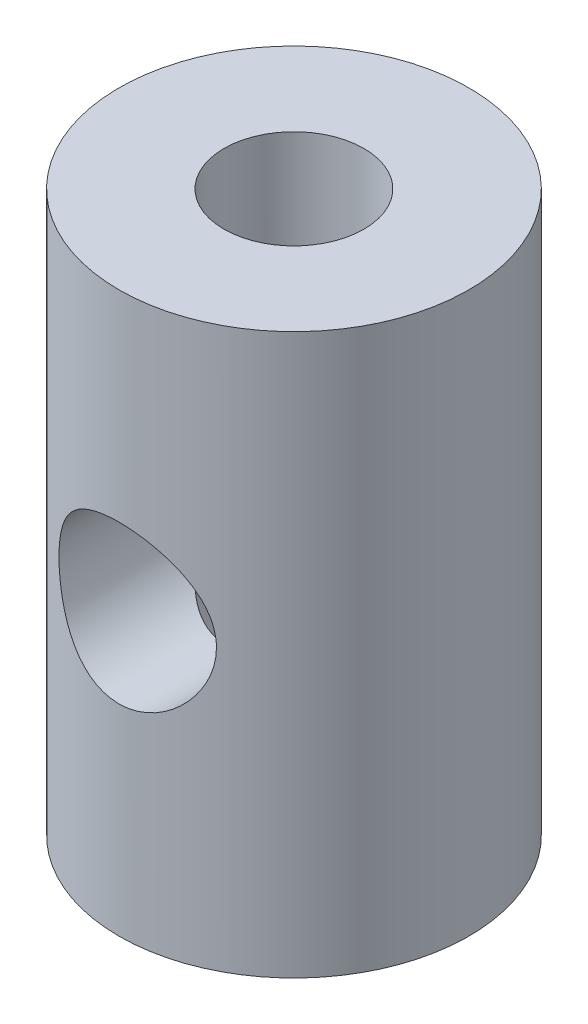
ISO-10303-21;
HEADER;
FILE_DESCRIPTION(('STEP AP214'),'2;1');
FILE_NAME('part.step','',(''),(''),'','','');
FILE_SCHEMA(('AUTOMOTIVE_DESIGN { 1 0 10303 214 1 1 1 1 }'));
ENDSEC;
DATA;
#1=APPLICATION_CONTEXT('core data for automotive mechanical design processes');
#2=APPLICATION_PROTOCOL_DEFINITION('international standard','automotive_design',2000,#1);
#3=PRODUCT_CONTEXT('',#1,'mechanical');
#4=PRODUCT('Part','Part','',(#3));
#5=PRODUCT_RELATED_PRODUCT_CATEGORY('part','',(#4));
#6=PRODUCT_DEFINITION_FORMATION('','',#4);
#7=PRODUCT_DEFINITION_CONTEXT('part definition',#1,'design');
#8=PRODUCT_DEFINITION('design','',#6,#7);
#9=PRODUCT_DEFINITION_SHAPE('','',#8);
#10=(LENGTH_UNIT() NAMED_UNIT(*) SI_UNIT(.MILLI.,.METRE.));
#11=(NAMED_UNIT(*) PLANE_ANGLE_UNIT() SI_UNIT($,.RADIAN.));
#12=(NAMED_UNIT(*) SI_UNIT($,.STERADIAN.) SOLID_ANGLE_UNIT());
#13=UNCERTAINTY_MEASURE_WITH_UNIT(LENGTH_MEASURE(1.E-05),#10,'distance_accuracy_value','');
#14=(GEOMETRIC_REPRESENTATION_CONTEXT(3) GLOBAL_UNCERTAINTY_ASSIGNED_CONTEXT((#13)) GLOBAL_UNIT_ASSIGNED_CONTEXT((#10,
#11,#12)) REPRESENTATION_CONTEXT('',''));
#15=CARTESIAN_POINT('',(0.,0.,0.));
#16=DIRECTION('',(0.,0.,1.));
#17=DIRECTION('',(1.,0.,0.));
#18=AXIS2_PLACEMENT_3D('',#15,#16,#17);
#19=CARTESIAN_POINT('',(0.,16.,0.));
#20=DIRECTION('',(0.,-1.,0.));
#21=DIRECTION('',(0.,0.,-1.));
#22=AXIS2_PLACEMENT_3D('',#19,#20,#21);
#23=CYLINDRICAL_SURFACE('',#22,2.);
#24=CARTESIAN_POINT('',(0.,10.25,-2.));
#25=CARTESIAN_POINT('',(-0.0929564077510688,10.2499928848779,-1.99999277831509));
#26=CARTESIAN_POINT('',(-0.186058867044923,10.2441806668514,-1.99346015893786));
#27=CARTESIAN_POINT('',(-0.369214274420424,10.2214292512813,-1.96781134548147));
#28=CARTESIAN_POINT('',(-0.459259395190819,10.2044634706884,-1.94866508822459));
#29=CARTESIAN_POINT('',(-0.633059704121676,10.1609505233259,-1.89930052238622));
#30=CARTESIAN_POINT('',(-0.716853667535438,10.1344696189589,-1.86915876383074));
#31=CARTESIAN_POINT('',(-0.877280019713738,10.073705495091,-1.79945647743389));
#32=CARTESIAN_POINT('',(-0.953912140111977,10.0394219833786,-1.75989559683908));
#33=CARTESIAN_POINT('',(-1.12793372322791,9.95018206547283,-1.65580731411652));
#34=CARTESIAN_POINT('',(-1.22165621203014,9.89239449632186,-1.58757647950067));
#35=CARTESIAN_POINT('',(-1.39363403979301,9.76960730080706,-1.43901519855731));
#36=CARTESIAN_POINT('',(-1.47184818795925,9.70458916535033,-1.35865350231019));
#37=CARTESIAN_POINT('',(-1.61463934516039,9.57010119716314,-1.18567391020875));
#38=CARTESIAN_POINT('',(-1.67886658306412,9.50056382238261,-1.09281925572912));
#39=CARTESIAN_POINT('',(-1.76327556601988,9.39832963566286,-0.945537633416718));
#40=CARTESIAN_POINT('',(-1.78941260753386,9.3646141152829,-0.895139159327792));
#41=CARTESIAN_POINT('',(-1.8376552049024,9.29891345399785,-0.791389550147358));
#42=CARTESIAN_POINT('',(-1.85976357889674,9.26692711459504,-0.738040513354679));
#43=CARTESIAN_POINT('',(-1.89995996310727,9.2058201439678,-0.627418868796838));
#44=CARTESIAN_POINT('',(-1.91800292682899,9.17673344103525,-0.570110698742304));
#45=CARTESIAN_POINT('',(-1.94927987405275,9.12416284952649,-0.451713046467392));
#46=CARTESIAN_POINT('',(-1.96252088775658,9.10067078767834,-0.390629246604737));
#47=CARTESIAN_POINT('',(-1.98170478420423,9.06568420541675,-0.275101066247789));
#48=CARTESIAN_POINT('',(-1.98849014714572,9.05285143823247,-0.221218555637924));
#49=CARTESIAN_POINT('',(-1.99762242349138,9.03542692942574,-0.111807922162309));
#50=CARTESIAN_POINT('',(-1.99997899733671,9.03081725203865,-0.0562836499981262));
#51=CARTESIAN_POINT('',(-2.00002077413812,9.030736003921,0.0549240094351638));
#52=CARTESIAN_POINT('',(-1.99769344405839,9.03528895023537,0.110607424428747));
#53=CARTESIAN_POINT('',(-1.98859319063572,9.05265713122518,0.220329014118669));
#54=CARTESIAN_POINT('',(-1.98181075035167,9.06549005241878,0.274363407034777));
#55=CARTESIAN_POINT('',(-1.95983519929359,9.10557002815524,0.406952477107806));
#56=CARTESIAN_POINT('',(-1.94211061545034,9.13683578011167,0.483828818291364));
#57=CARTESIAN_POINT('',(-1.89917300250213,9.2072077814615,0.63176092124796));
#58=CARTESIAN_POINT('',(-1.87392844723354,9.24634680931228,0.702790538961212));
#59=CARTESIAN_POINT('',(-1.82034933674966,9.32315682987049,0.830964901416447));
#60=CARTESIAN_POINT('',(-1.79281996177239,9.3603780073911,0.888724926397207));
#61=CARTESIAN_POINT('',(-1.73277410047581,9.43608163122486,1.00076879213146));
#62=CARTESIAN_POINT('',(-1.70025427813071,9.47456490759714,1.05505027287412));
#63=CARTESIAN_POINT('',(-1.63028908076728,9.55156809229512,1.16023321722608));
#64=CARTESIAN_POINT('',(-1.5928475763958,9.59008794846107,1.21113729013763));
#65=CARTESIAN_POINT('',(-1.51297060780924,9.66627404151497,1.30955575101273));
#66=CARTESIAN_POINT('',(-1.47053442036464,9.70394015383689,1.35706964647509));
#67=CARTESIAN_POINT('',(-1.35275458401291,9.80038969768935,1.4767645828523));
#68=CARTESIAN_POINT('',(-1.27327849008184,9.85784198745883,1.54604850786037));
#69=CARTESIAN_POINT('',(-1.1009991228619,9.96482800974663,1.67308273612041));
#70=CARTESIAN_POINT('',(-1.00822197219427,10.0143768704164,1.73085512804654));
#71=CARTESIAN_POINT('',(-0.830902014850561,10.0927071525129,1.82135112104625));
#72=CARTESIAN_POINT('',(-0.748717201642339,10.1236646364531,1.85678709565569));
#73=CARTESIAN_POINT('',(-0.577684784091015,10.1764118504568,1.91689251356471));
#74=CARTESIAN_POINT('',(-0.488841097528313,10.1982069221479,1.94156823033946));
#75=CARTESIAN_POINT('',(-0.306029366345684,10.231034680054,1.97865895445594));
#76=CARTESIAN_POINT('',(-0.212031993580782,10.2419971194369,1.99099394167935));
#77=CARTESIAN_POINT('',(-0.0226158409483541,10.2518809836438,2.00211767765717));
#78=CARTESIAN_POINT('',(0.0728023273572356,10.2508074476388,2.00091209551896));
#79=CARTESIAN_POINT('',(0.251730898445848,10.2374851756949,1.98591260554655));
#80=CARTESIAN_POINT('',(0.335447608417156,10.2264103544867,1.97344101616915));
#81=CARTESIAN_POINT('',(0.499081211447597,10.1955305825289,1.93853567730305));
#82=CARTESIAN_POINT('',(0.578997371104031,10.1757239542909,1.91610001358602));
#83=CARTESIAN_POINT('',(0.736868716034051,10.1275898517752,1.8612681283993));
#84=CARTESIAN_POINT('',(0.814580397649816,10.0989239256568,1.82847486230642));
#85=CARTESIAN_POINT('',(0.963113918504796,10.0350575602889,1.75479221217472));
#86=CARTESIAN_POINT('',(1.03393336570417,9.99985486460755,1.71390003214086));
#87=CARTESIAN_POINT('',(1.20253143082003,9.90523967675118,1.60271147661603));
#88=CARTESIAN_POINT('',(1.2956478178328,9.84263415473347,1.52805264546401));
#89=CARTESIAN_POINT('',(1.46533078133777,9.71081449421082,1.36625170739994));
#90=CARTESIAN_POINT('',(1.54183517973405,9.6415768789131,1.27906466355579));
#91=CARTESIAN_POINT('',(1.64499481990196,9.53590283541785,1.13905378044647));
#92=CARTESIAN_POINT('',(1.67775234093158,9.4999550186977,1.09023407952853));
#93=CARTESIAN_POINT('',(1.7390038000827,9.42848782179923,0.989616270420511));
#94=CARTESIAN_POINT('',(1.76749541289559,9.39296868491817,0.937816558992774));
#95=CARTESIAN_POINT('',(1.82004009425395,9.32357121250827,0.831247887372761));
#96=CARTESIAN_POINT('',(1.84410780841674,9.28968774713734,0.776489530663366));
#97=CARTESIAN_POINT('',(1.88770084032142,9.22499001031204,0.663511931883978));
#98=CARTESIAN_POINT('',(1.90723208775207,9.19417176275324,0.605297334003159));
#99=CARTESIAN_POINT('',(1.93952111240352,9.14088746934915,0.49130426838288));
#100=CARTESIAN_POINT('',(1.95277905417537,9.11788124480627,0.435927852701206));
#101=CARTESIAN_POINT('',(1.97475253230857,9.07859220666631,0.322027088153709));
#102=CARTESIAN_POINT('',(1.98347964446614,9.06229228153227,0.263511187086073));
#103=CARTESIAN_POINT('',(1.99580152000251,9.03897445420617,0.143086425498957));
#104=CARTESIAN_POINT('',(1.99931831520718,9.03209767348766,0.0811401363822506));
#105=CARTESIAN_POINT('',(2.00049992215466,9.02980777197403,-0.0430078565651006));
#106=CARTESIAN_POINT('',(1.99816730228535,9.03438961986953,-0.105209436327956));
#107=CARTESIAN_POINT('',(1.98761499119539,9.054518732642,-0.231779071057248));
#108=CARTESIAN_POINT('',(1.97898519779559,9.07082864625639,-0.295982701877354));
#109=CARTESIAN_POINT('',(1.95627452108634,9.11176862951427,-0.420767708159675));
#110=CARTESIAN_POINT('',(1.942171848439,9.13643190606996,-0.481333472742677));
#111=CARTESIAN_POINT('',(1.91109037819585,9.18787056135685,-0.592172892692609));
#112=CARTESIAN_POINT('',(1.89460258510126,9.21411015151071,-0.642843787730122));
#113=CARTESIAN_POINT('',(1.85819887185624,9.26912991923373,-0.741526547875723));
#114=CARTESIAN_POINT('',(1.83828019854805,9.29791212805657,-0.789536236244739));
#115=CARTESIAN_POINT('',(1.77359465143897,9.38642509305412,-0.93007280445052));
#116=CARTESIAN_POINT('',(1.72392060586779,9.44828250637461,-1.01903042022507));
#117=CARTESIAN_POINT('',(1.60623869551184,9.57828624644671,-1.19685297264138));
#118=CARTESIAN_POINT('',(1.53689445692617,9.64644308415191,-1.28481963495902));
#119=CARTESIAN_POINT('',(1.3824653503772,9.77807708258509,-1.44965260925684));
#120=CARTESIAN_POINT('',(1.29740762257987,9.84156205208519,-1.52653765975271));
#121=CARTESIAN_POINT('',(1.12925070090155,9.94813101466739,-1.65337339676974));
#122=CARTESIAN_POINT('',(1.04892342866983,9.99279007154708,-1.70566013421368));
#123=CARTESIAN_POINT('',(0.878244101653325,10.0736611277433,-1.79948256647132));
#124=CARTESIAN_POINT('',(0.787899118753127,10.1098790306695,-1.84102577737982));
#125=CARTESIAN_POINT('',(0.613247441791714,10.1664532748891,-1.90557609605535));
#126=CARTESIAN_POINT('',(0.530146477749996,10.1883918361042,-1.93045067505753));
#127=CARTESIAN_POINT('',(0.35964484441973,10.2227612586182,-1.96932773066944));
#128=CARTESIAN_POINT('',(0.272255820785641,10.2352165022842,-1.98335809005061));
#129=CARTESIAN_POINT('',(0.153489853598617,10.2449692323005,-1.99433891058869));
#130=CARTESIAN_POINT('',(0.122867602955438,10.2468524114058,-1.99645842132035));
#131=CARTESIAN_POINT('',(0.0615022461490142,10.2493690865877,-1.99929028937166));
#132=CARTESIAN_POINT('',(0.0307591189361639,10.2500023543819,-2.00000238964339));
#133=CARTESIAN_POINT('',(0.,10.25,-2.));
#134=B_SPLINE_CURVE_WITH_KNOTS('',3,(#24,#25,#26,#27,#28,#29,#30,#31,#32,#33,#34,#35,#36,#37,
#38,#39,#40,#41,#42,#43,#44,#45,#46,#47,#48,#49,#50,#51,#52,#53,#54,#55,#56,#57,#58,#59,#60,#61,
#62,#63,#64,#65,#66,#67,#68,#69,#70,#71,#72,#73,#74,#75,#76,#77,#78,#79,#80,#81,#82,#83,#84,#85,
#86,#87,#88,#89,#90,#91,#92,#93,#94,#95,#96,#97,#98,#99,#100,#101,#102,#103,#104,#105,#106,#107,
#108,#109,#110,#111,#112,#113,#114,#115,#116,#117,#118,#119,#120,#121,#122,#123,#124,#125,#126,
#127,#128,#129,#130,#131,#132,#133),.UNSPECIFIED.,.T.,.F.,(4,2,2,2,2,2,2,2,2,2,2,2,2,2,2,2,2,2,
2,2,2,2,2,2,2,2,2,2,2,2,2,2,2,2,2,2,2,2,2,2,2,2,2,2,2,2,2,2,2,2,2,2,2,2,4),(0.,
0.278730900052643,0.558128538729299,0.835617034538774,1.11311592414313,1.49959348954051,
1.88708419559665,2.28336880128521,2.48130251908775,2.67909724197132,2.87898623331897,
3.07858138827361,3.24532666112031,3.4117077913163,3.57853471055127,3.74571916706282,
3.99886924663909,4.25309591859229,4.47488672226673,4.69682644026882,4.91859264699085,
5.14039100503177,5.49922632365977,5.85736632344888,6.14034666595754,6.42316180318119,
6.7077991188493,6.99231726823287,7.2472434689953,7.50221866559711,7.76848356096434,
8.03484053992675,8.43698820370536,8.84061609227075,9.0471915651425,9.25387923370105,
9.4598698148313,9.66558960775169,9.84937516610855,10.0326888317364,10.2187188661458,
10.4046672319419,10.6039477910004,10.8040300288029,10.9819699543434,11.1600533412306,
11.5164851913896,11.9085488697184,12.2999416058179,12.6160291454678,12.9318949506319,
13.1992189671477,13.4658533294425,13.5580680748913,13.6502996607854),.UNSPECIFIED.);
#135=CARTESIAN_POINT('',(0.,10.25,-2.));
#136=VERTEX_POINT('',#135);
#137=EDGE_CURVE('E35',#136,#136,#134,.T.);
#138=ORIENTED_EDGE('',*,*,#137,.F.);
#139=EDGE_LOOP('',(#138));
#140=FACE_BOUND('',#139,.T.);
#141=CARTESIAN_POINT('',(0.,16.,0.));
#142=DIRECTION('',(0.,1.,0.));
#143=DIRECTION('',(0.,0.,1.));
#144=AXIS2_PLACEMENT_3D('',#141,#142,#143);
#145=CIRCLE('',#144,2.);
#146=CARTESIAN_POINT('',(0.,16.,2.));
#147=VERTEX_POINT('',#146);
#148=EDGE_CURVE('E48',#147,#147,#145,.T.);
#149=ORIENTED_EDGE('',*,*,#148,.T.);
#150=EDGE_LOOP('',(#149));
#151=FACE_BOUND('',#150,.T.);
#152=ADVANCED_FACE('F30',(#140,#151),#23,.F.);
#153=CARTESIAN_POINT('',(0.,16.,0.));
#154=DIRECTION('',(0.,1.,0.));
#155=DIRECTION('',(0.,0.,1.));
#156=AXIS2_PLACEMENT_3D('',#153,#154,#155);
#157=PLANE('',#156);
#158=CARTESIAN_POINT('',(0.,16.,0.));
#159=DIRECTION('',(0.,1.,0.));
#160=DIRECTION('',(0.,0.,1.));
#161=AXIS2_PLACEMENT_3D('',#158,#159,#160);
#162=CIRCLE('',#161,5.);
#163=CARTESIAN_POINT('',(0.,16.,5.));
#164=VERTEX_POINT('',#163);
#165=EDGE_CURVE('E10',#164,#164,#162,.T.);
#166=ORIENTED_EDGE('',*,*,#165,.T.);
#167=EDGE_LOOP('',(#166));
#168=FACE_BOUND('',#167,.T.);
#169=ORIENTED_EDGE('',*,*,#148,.F.);
#170=EDGE_LOOP('',(#169));
#171=FACE_BOUND('',#170,.T.);
#172=ADVANCED_FACE('F82',(#168,#171),#157,.T.);
#173=CARTESIAN_POINT('',(0.,0.,0.));
#174=DIRECTION('',(0.,1.,0.));
#175=DIRECTION('',(0.,0.,1.));
#176=AXIS2_PLACEMENT_3D('',#173,#174,#175);
#177=PLANE('',#176);
#178=CARTESIAN_POINT('',(0.,0.,0.));
#179=DIRECTION('',(0.,1.,0.));
#180=DIRECTION('',(0.,0.,1.));
#181=AXIS2_PLACEMENT_3D('',#178,#179,#180);
#182=CIRCLE('',#181,5.);
#183=CARTESIAN_POINT('',(0.,0.,5.));
#184=VERTEX_POINT('',#183);
#185=EDGE_CURVE('E43',#184,#184,#182,.T.);
#186=ORIENTED_EDGE('',*,*,#185,.F.);
#187=EDGE_LOOP('',(#186));
#188=FACE_BOUND('',#187,.T.);
#189=CARTESIAN_POINT('',(0.,0.,0.));
#190=DIRECTION('',(0.,1.,0.));
#191=DIRECTION('',(0.,0.,1.));
#192=AXIS2_PLACEMENT_3D('',#189,#190,#191);
#193=CIRCLE('',#192,2.);
#194=CARTESIAN_POINT('',(0.,0.,2.));
#195=VERTEX_POINT('',#194);
#196=EDGE_CURVE('E76',#195,#195,#193,.T.);
#197=ORIENTED_EDGE('',*,*,#196,.T.);
#198=EDGE_LOOP('',(#197));
#199=FACE_BOUND('',#198,.T.);
#200=ADVANCED_FACE('F84',(#188,#199),#177,.F.);
#201=CARTESIAN_POINT('',(0.,16.,0.));
#202=DIRECTION('',(0.,-1.,0.));
#203=DIRECTION('',(0.,0.,-1.));
#204=AXIS2_PLACEMENT_3D('',#201,#202,#203);
#205=CYLINDRICAL_SURFACE('',#204,5.);
#206=CARTESIAN_POINT('',(0.,10.25,-5.));
#207=CARTESIAN_POINT('',(-0.119657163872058,10.2499941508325,-4.9999951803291));
#208=CARTESIAN_POINT('',(-0.239497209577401,10.240398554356,-4.9956568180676));
#209=CARTESIAN_POINT('',(-0.47572081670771,10.2024004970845,-4.97873356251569));
#210=CARTESIAN_POINT('',(-0.59209555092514,10.1739536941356,-4.96612922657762));
#211=CARTESIAN_POINT('',(-0.817598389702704,10.0995417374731,-4.93401032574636));
#212=CARTESIAN_POINT('',(-0.926750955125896,10.0536396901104,-4.91452067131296));
#213=CARTESIAN_POINT('',(-1.13568251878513,9.94590630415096,-4.87048664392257));
#214=CARTESIAN_POINT('',(-1.23546350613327,9.88407835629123,-4.84594334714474));
#215=CARTESIAN_POINT('',(-1.42864166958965,9.74257025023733,-4.7926545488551));
#216=CARTESIAN_POINT('',(-1.52144083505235,9.66213152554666,-4.76375726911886));
#217=CARTESIAN_POINT('',(-1.69276142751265,9.48729760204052,-4.7056093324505));
#218=CARTESIAN_POINT('',(-1.77127412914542,9.3928939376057,-4.67635847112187));
#219=CARTESIAN_POINT('',(-1.91644184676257,9.18602120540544,-4.61884309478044));
#220=CARTESIAN_POINT('',(-1.98211224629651,9.07281109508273,-4.59074106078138));
#221=CARTESIAN_POINT('',(-2.09321326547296,8.83551854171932,-4.54116574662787));
#222=CARTESIAN_POINT('',(-2.13865597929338,8.7114426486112,-4.51968850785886));
#223=CARTESIAN_POINT('',(-2.2054422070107,8.462806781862,-4.48746493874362));
#224=CARTESIAN_POINT('',(-2.22794402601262,8.33862717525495,-4.47620638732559));
#225=CARTESIAN_POINT('',(-2.25180742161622,8.08778459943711,-4.46425372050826));
#226=CARTESIAN_POINT('',(-2.25318367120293,7.96112341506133,-4.46355227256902));
#227=CARTESIAN_POINT('',(-2.23561914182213,7.72141805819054,-4.47236713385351));
#228=CARTESIAN_POINT('',(-2.2185407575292,7.60819554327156,-4.48094689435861));
#229=CARTESIAN_POINT('',(-2.16771485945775,7.38643802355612,-4.5057522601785));
#230=CARTESIAN_POINT('',(-2.13396347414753,7.27790411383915,-4.52197964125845));
#231=CARTESIAN_POINT('',(-2.05008139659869,7.06566133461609,-4.56062840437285));
#232=CARTESIAN_POINT('',(-1.99959732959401,6.96211723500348,-4.58318164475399));
#233=CARTESIAN_POINT('',(-1.88393825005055,6.76452590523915,-4.63192287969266));
#234=CARTESIAN_POINT('',(-1.81875698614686,6.67048274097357,-4.65811241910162));
#235=CARTESIAN_POINT('',(-1.66791131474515,6.48464932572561,-4.71435794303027));
#236=CARTESIAN_POINT('',(-1.58084940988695,6.39402761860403,-4.74453849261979));
#237=CARTESIAN_POINT('',(-1.39252160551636,6.22824166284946,-4.80318714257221));
#238=CARTESIAN_POINT('',(-1.2912512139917,6.15308232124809,-4.83165469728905));
#239=CARTESIAN_POINT('',(-1.07332333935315,6.01823622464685,-4.88476427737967));
#240=CARTESIAN_POINT('',(-0.956286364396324,5.95910093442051,-4.90926046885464));
#241=CARTESIAN_POINT('',(-0.712539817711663,5.86178202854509,-4.95050723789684));
#242=CARTESIAN_POINT('',(-0.585836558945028,5.82358486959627,-4.96726282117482));
#243=CARTESIAN_POINT('',(-0.336050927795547,5.77184799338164,-4.99015693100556));
#244=CARTESIAN_POINT('',(-0.213354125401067,5.75674488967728,-4.99696705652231));
#245=CARTESIAN_POINT('',(0.0330028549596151,5.74687062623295,-5.00140648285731));
#246=CARTESIAN_POINT('',(0.156662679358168,5.75209232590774,-4.99903900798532));
#247=CARTESIAN_POINT('',(0.393606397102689,5.78167252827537,-4.98581223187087));
#248=CARTESIAN_POINT('',(0.507068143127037,5.80486612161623,-4.97547003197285));
#249=CARTESIAN_POINT('',(0.728326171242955,5.86803312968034,-4.94792660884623));
#250=CARTESIAN_POINT('',(0.836121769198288,5.90800856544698,-4.93072455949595));
#251=CARTESIAN_POINT('',(1.0468032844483,6.00486454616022,-4.89040595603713));
#252=CARTESIAN_POINT('',(1.14943204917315,6.06223242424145,-4.86712201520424));
#253=CARTESIAN_POINT('',(1.34397554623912,6.19171384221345,-4.81703610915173));
#254=CARTESIAN_POINT('',(1.43588556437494,6.26383383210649,-4.79023260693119));
#255=CARTESIAN_POINT('',(1.61437331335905,6.427690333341,-4.73321088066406));
#256=CARTESIAN_POINT('',(1.69988735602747,6.52055366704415,-4.70289328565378));
#257=CARTESIAN_POINT('',(1.85448776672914,6.71966056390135,-4.64410716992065));
#258=CARTESIAN_POINT('',(1.92356783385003,6.82590923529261,-4.61563936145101));
#259=CARTESIAN_POINT('',(2.0448687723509,7.05241199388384,-4.56322301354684));
#260=CARTESIAN_POINT('',(2.0966129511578,7.17295491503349,-4.53940877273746));
#261=CARTESIAN_POINT('',(2.17856642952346,7.42246637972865,-4.50065987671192));
#262=CARTESIAN_POINT('',(2.20879749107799,7.55142626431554,-4.4857162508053));
#263=CARTESIAN_POINT('',(2.24454528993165,7.802147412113,-4.46792778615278));
#264=CARTESIAN_POINT('',(2.25196758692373,7.92357111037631,-4.46415115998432));
#265=CARTESIAN_POINT('',(2.24714266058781,8.16591064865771,-4.46658268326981));
#266=CARTESIAN_POINT('',(2.23489992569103,8.28682659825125,-4.47278855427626));
#267=CARTESIAN_POINT('',(2.19277345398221,8.5167678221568,-4.49357716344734));
#268=CARTESIAN_POINT('',(2.16405328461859,8.62606166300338,-4.50760581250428));
#269=CARTESIAN_POINT('',(2.09103437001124,8.83825696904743,-4.54193721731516));
#270=CARTESIAN_POINT('',(2.04673109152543,8.94115656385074,-4.56224179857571));
#271=CARTESIAN_POINT('',(1.94052895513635,9.14494258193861,-4.60845986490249));
#272=CARTESIAN_POINT('',(1.87767694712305,9.24526778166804,-4.63465129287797));
#273=CARTESIAN_POINT('',(1.7373806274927,9.43453794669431,-4.68904747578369));
#274=CARTESIAN_POINT('',(1.65993003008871,9.52347798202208,-4.71725309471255));
#275=CARTESIAN_POINT('',(1.48434630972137,9.69578262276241,-4.77556462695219));
#276=CARTESIAN_POINT('',(1.3849750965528,9.77791205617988,-4.8056111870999));
#277=CARTESIAN_POINT('',(1.17282336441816,9.92447460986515,-4.8617393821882));
#278=CARTESIAN_POINT('',(1.06003671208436,9.98889959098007,-4.88781919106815));
#279=CARTESIAN_POINT('',(0.825071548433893,10.0972194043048,-4.93289199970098));
#280=CARTESIAN_POINT('',(0.702997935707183,10.1413126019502,-4.95195309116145));
#281=CARTESIAN_POINT('',(0.452281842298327,10.2078630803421,-4.9810892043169));
#282=CARTESIAN_POINT('',(0.323660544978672,10.2303859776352,-4.9911914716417));
#283=CARTESIAN_POINT('',(0.161835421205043,10.244407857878,-4.99748612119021));
#284=CARTESIAN_POINT('',(0.129515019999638,10.2465028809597,-4.99842714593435));
#285=CARTESIAN_POINT('',(0.0648008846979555,10.2492997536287,-4.99968474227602));
#286=CARTESIAN_POINT('',(0.032407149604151,10.2500015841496,-5.00000130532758));
#287=CARTESIAN_POINT('',(0.,10.25,-5.));
#288=B_SPLINE_CURVE_WITH_KNOTS('',3,(#206,#207,#208,#209,#210,#211,#212,#213,#214,#215,#216,
#217,#218,#219,#220,#221,#222,#223,#224,#225,#226,#227,#228,#229,#230,#231,#232,#233,#234,#235,
#236,#237,#238,#239,#240,#241,#242,#243,#244,#245,#246,#247,#248,#249,#250,#251,#252,#253,#254,
#255,#256,#257,#258,#259,#260,#261,#262,#263,#264,#265,#266,#267,#268,#269,#270,#271,#272,#273,
#274,#275,#276,#277,#278,#279,#280,#281,#282,#283,#284,#285,#286,#287),.UNSPECIFIED.,.T.,.F.,(4,
2,2,2,2,2,2,2,2,2,2,2,2,2,2,2,2,2,2,2,2,2,2,2,2,2,2,2,2,2,2,2,2,2,2,2,2,2,2,2,4),(0.,
0.358838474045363,0.718524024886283,1.07692137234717,1.43524247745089,1.81211589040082,
2.18921870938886,2.58877923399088,2.98810053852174,3.36607753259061,3.74379198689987,
4.08666490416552,4.42961747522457,4.78033096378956,5.13119390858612,5.51719011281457,
5.90330862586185,6.30138888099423,6.69921134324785,7.06867955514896,7.43801797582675,
7.78523528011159,8.13249441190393,8.49055929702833,8.84878107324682,9.23652488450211,
9.62441712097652,10.0222360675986,10.4196520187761,10.782814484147,11.1458940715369,
11.486031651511,11.8262682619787,12.1885231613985,12.5509343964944,12.9461798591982,
13.3416067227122,13.7330894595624,14.1233774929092,14.2205615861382,14.3177470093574),.UNSPECIFIED.);
#289=CARTESIAN_POINT('',(0.,10.25,-5.));
#290=VERTEX_POINT('',#289);
#291=EDGE_CURVE('E71',#290,#290,#288,.T.);
#292=ORIENTED_EDGE('',*,*,#291,.T.);
#293=EDGE_LOOP('',(#292));
#294=FACE_BOUND('',#293,.T.);
#295=CARTESIAN_POINT('',(2.25,8.,4.46514277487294));
#296=CARTESIAN_POINT('',(2.24999304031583,7.8810387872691,4.46515039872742));
#297=CARTESIAN_POINT('',(2.24050444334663,7.76188521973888,4.4699666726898));
#298=CARTESIAN_POINT('',(2.20296952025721,7.52710182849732,4.48857891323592));
#299=CARTESIAN_POINT('',(2.17487687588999,7.41148155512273,4.50239729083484));
#300=CARTESIAN_POINT('',(2.10149811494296,7.18758402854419,4.53710585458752));
#301=CARTESIAN_POINT('',(2.05629003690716,7.07927603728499,4.55796389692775));
#302=CARTESIAN_POINT('',(1.95019826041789,6.87180924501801,4.6043530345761));
#303=CARTESIAN_POINT('',(1.88931647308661,6.77264933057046,4.62988356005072));
#304=CARTESIAN_POINT('',(1.74886682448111,6.57901523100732,4.6848168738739));
#305=CARTESIAN_POINT('',(1.66832919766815,6.48528506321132,4.71436409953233));
#306=CARTESIAN_POINT('',(1.49288314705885,6.31210092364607,4.77282391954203));
#307=CARTESIAN_POINT('',(1.39796864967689,6.23265301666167,4.80173623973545));
#308=CARTESIAN_POINT('',(1.19040340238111,6.08626420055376,4.85747480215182));
#309=CARTESIAN_POINT('',(1.07708634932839,6.02019024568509,4.88411395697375));
#310=CARTESIAN_POINT('',(0.839526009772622,5.90837301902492,4.93049745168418));
#311=CARTESIAN_POINT('',(0.715288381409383,5.86261929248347,4.95024533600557));
#312=CARTESIAN_POINT('',(0.467253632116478,5.79553127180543,4.97959116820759));
#313=CARTESIAN_POINT('',(0.343870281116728,5.77290580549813,4.98972320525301));
#314=CARTESIAN_POINT('',(0.0946715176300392,5.74851393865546,5.00065622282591));
#315=CARTESIAN_POINT('',(-0.0311427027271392,5.7467375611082,5.00146166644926));
#316=CARTESIAN_POINT('',(-0.272124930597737,5.76348461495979,4.99394241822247));
#317=CARTESIAN_POINT('',(-0.387416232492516,5.78058029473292,4.98625984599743));
#318=CARTESIAN_POINT('',(-0.613288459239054,5.83209818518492,4.96354367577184));
#319=CARTESIAN_POINT('',(-0.723869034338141,5.86652167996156,4.94850953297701));
#320=CARTESIAN_POINT('',(-0.939228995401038,5.95207805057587,4.91222614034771));
#321=CARTESIAN_POINT('',(-1.04389475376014,6.00345678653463,4.8908859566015));
#322=CARTESIAN_POINT('',(-1.24339321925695,6.12119629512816,4.84401587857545));
#323=CARTESIAN_POINT('',(-1.3382223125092,6.1875625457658,4.81848445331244));
#324=CARTESIAN_POINT('',(-1.52345175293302,6.33955583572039,4.76331481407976));
#325=CARTESIAN_POINT('',(-1.61288673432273,6.42630082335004,4.73351145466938));
#326=CARTESIAN_POINT('',(-1.77639992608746,6.61350730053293,4.67460929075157));
#327=CARTESIAN_POINT('',(-1.85047011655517,6.71397590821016,4.6455108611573));
#328=CARTESIAN_POINT('',(-1.9842398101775,6.93123567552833,4.59001891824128));
#329=CARTESIAN_POINT('',(-2.04317215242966,7.04854743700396,4.56379860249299));
#330=CARTESIAN_POINT('',(-2.14003834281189,7.29291404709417,4.51919374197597));
#331=CARTESIAN_POINT('',(-2.17799005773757,7.41996050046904,4.50080253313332));
#332=CARTESIAN_POINT('',(-2.22914248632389,7.67049373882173,4.47567706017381));
#333=CARTESIAN_POINT('',(-2.24392437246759,7.79358138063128,4.46820077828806));
#334=CARTESIAN_POINT('',(-2.25302242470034,8.04067931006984,4.46362263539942));
#335=CARTESIAN_POINT('',(-2.2473478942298,8.16468915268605,4.46651605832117));
#336=CARTESIAN_POINT('',(-2.21714216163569,8.39960016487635,4.48157509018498));
#337=CARTESIAN_POINT('',(-2.19415743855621,8.51075580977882,4.49297960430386));
#338=CARTESIAN_POINT('',(-2.13212542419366,8.72749965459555,4.52274424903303));
#339=CARTESIAN_POINT('',(-2.09307393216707,8.83308639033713,4.54110619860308));
#340=CARTESIAN_POINT('',(-1.99809284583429,9.04104817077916,4.58371481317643));
#341=CARTESIAN_POINT('',(-1.94148122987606,9.14306336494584,4.60818960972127));
#342=CARTESIAN_POINT('',(-1.81362927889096,9.33668361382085,4.65998955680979));
#343=CARTESIAN_POINT('',(-1.74238196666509,9.42828367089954,4.68731606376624));
#344=CARTESIAN_POINT('',(-1.57908877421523,9.60782553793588,4.74496334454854));
#345=CARTESIAN_POINT('',(-1.48568977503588,9.69453189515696,4.77531541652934));
#346=CARTESIAN_POINT('',(-1.28502997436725,9.85132654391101,4.8331762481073));
#347=CARTESIAN_POINT('',(-1.17776699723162,9.92141222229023,4.86068456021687));
#348=CARTESIAN_POINT('',(-0.950682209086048,10.0433961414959,4.91017542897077));
#349=CARTESIAN_POINT('',(-0.830745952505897,10.0951062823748,4.93210022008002));
#350=CARTESIAN_POINT('',(-0.582619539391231,10.1771762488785,4.96751583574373));
#351=CARTESIAN_POINT('',(-0.454435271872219,10.2075511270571,4.98101260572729));
#352=CARTESIAN_POINT('',(-0.204394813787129,10.2439710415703,4.99726613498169));
#353=CARTESIAN_POINT('',(-0.0828396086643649,10.2517498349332,5.00078768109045));
#354=CARTESIAN_POINT('',(0.15984827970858,10.2475911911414,4.99891579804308));
#355=CARTESIAN_POINT('',(0.280981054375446,10.2356583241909,4.99352443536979));
#356=CARTESIAN_POINT('',(0.513549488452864,10.1936476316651,4.97486307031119));
#357=CARTESIAN_POINT('',(0.625174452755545,10.1644355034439,4.96196940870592));
#358=CARTESIAN_POINT('',(0.84184525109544,10.089721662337,4.92983796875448));
#359=CARTESIAN_POINT('',(0.946889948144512,10.0442171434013,4.9105990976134));
#360=CARTESIAN_POINT('',(1.1527517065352,9.93592510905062,4.86649288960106));
#361=CARTESIAN_POINT('',(1.25315478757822,9.87244147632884,4.84140812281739));
#362=CARTESIAN_POINT('',(1.4423245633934,9.73094458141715,4.78846161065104));
#363=CARTESIAN_POINT('',(1.53108621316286,9.65292505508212,4.76059867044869));
#364=CARTESIAN_POINT('',(1.70196716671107,9.47716364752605,4.70235094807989));
#365=CARTESIAN_POINT('',(1.78296764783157,9.37833667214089,4.67194455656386));
#366=CARTESIAN_POINT('',(1.92749297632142,9.16773520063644,4.61420006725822));
#367=CARTESIAN_POINT('',(1.99100658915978,9.05595244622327,4.58686394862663));
#368=CARTESIAN_POINT('',(2.09879543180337,8.82115153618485,4.53856864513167));
#369=CARTESIAN_POINT('',(2.14295192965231,8.69806949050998,4.51764904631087));
#370=CARTESIAN_POINT('',(2.19275164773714,8.50854501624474,4.49356898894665));
#371=CARTESIAN_POINT('',(2.20660710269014,8.44461510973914,4.48676181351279));
#372=CARTESIAN_POINT('',(2.22871677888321,8.31558360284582,4.47582163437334));
#373=CARTESIAN_POINT('',(2.2369751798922,8.25048291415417,4.47168663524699));
#374=CARTESIAN_POINT('',(2.2449126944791,8.15434233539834,4.46770340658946));
#375=CARTESIAN_POINT('',(2.24681915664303,8.12351408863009,4.46674464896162));
#376=CARTESIAN_POINT('',(2.24936373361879,8.06179488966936,4.46546333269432));
#377=CARTESIAN_POINT('',(2.25000180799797,8.03090393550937,4.46514079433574));
#378=CARTESIAN_POINT('',(2.25,8.,4.46514277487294));
#379=B_SPLINE_CURVE_WITH_KNOTS('',3,(#295,#296,#297,#298,#299,#300,#301,#302,#303,#304,#305,
#306,#307,#308,#309,#310,#311,#312,#313,#314,#315,#316,#317,#318,#319,#320,#321,#322,#323,#324,
#325,#326,#327,#328,#329,#330,#331,#332,#333,#334,#335,#336,#337,#338,#339,#340,#341,#342,#343,
#344,#345,#346,#347,#348,#349,#350,#351,#352,#353,#354,#355,#356,#357,#358,#359,#360,#361,#362,
#363,#364,#365,#366,#367,#368,#369,#370,#371,#372,#373,#374,#375,#376,#377,#378),.UNSPECIFIED.,
.T.,.F.,(4,2,2,2,2,2,2,2,2,2,2,2,2,2,2,2,2,2,2,2,2,2,2,2,2,2,2,2,2,2,2,2,2,2,2,2,2,2,2,2,2,4),
(0.,0.356759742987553,0.714411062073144,1.07045091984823,1.4264473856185,1.80599601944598,
2.18570544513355,2.58519198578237,2.98447275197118,3.35999219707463,3.73533193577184,
4.08410830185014,4.43291051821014,4.78701075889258,5.14124063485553,5.52388400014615,
5.90672659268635,6.30625734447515,6.70544733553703,7.0759816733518,7.44634751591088,
7.78705357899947,8.1278487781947,8.48402022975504,8.84036187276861,9.23157909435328,
9.62285778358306,10.0180336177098,10.412930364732,10.7766046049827,11.1401945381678,
11.4869501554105,11.83376552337,12.1964652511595,12.5593216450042,12.9515422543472,
13.3440142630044,13.7388610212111,13.9359176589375,14.1328269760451,14.2255036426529,
14.318183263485),.UNSPECIFIED.);
#380=CARTESIAN_POINT('',(2.25,8.,4.46514277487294));
#381=VERTEX_POINT('',#380);
#382=EDGE_CURVE('E67',#381,#381,#379,.T.);
#383=ORIENTED_EDGE('',*,*,#382,.T.);
#384=EDGE_LOOP('',(#383));
#385=FACE_BOUND('',#384,.T.);
#386=ORIENTED_EDGE('',*,*,#165,.F.);
#387=EDGE_LOOP('',(#386));
#388=FACE_BOUND('',#387,.T.);
#389=ORIENTED_EDGE('',*,*,#185,.T.);
#390=EDGE_LOOP('',(#389));
#391=FACE_BOUND('',#390,.T.);
#392=ADVANCED_FACE('F32',(#294,#385,#388,#391),#205,.T.);
#393=CARTESIAN_POINT('',(0.,5.75,-2.));
#394=CARTESIAN_POINT('',(0.0929564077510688,5.75000711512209,-1.99999277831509));
#395=CARTESIAN_POINT('',(0.186058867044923,5.75581933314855,-1.99346015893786));
#396=CARTESIAN_POINT('',(0.369214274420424,5.77857074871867,-1.96781134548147));
#397=CARTESIAN_POINT('',(0.459259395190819,5.79553652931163,-1.94866508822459));
#398=CARTESIAN_POINT('',(0.633059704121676,5.83904947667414,-1.89930052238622));
#399=CARTESIAN_POINT('',(0.716853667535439,5.86553038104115,-1.86915876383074));
#400=CARTESIAN_POINT('',(0.877280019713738,5.92629450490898,-1.79945647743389));
#401=CARTESIAN_POINT('',(0.953912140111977,5.9605780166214,-1.75989559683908));
#402=CARTESIAN_POINT('',(1.12793372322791,6.04981793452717,-1.65580731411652));
#403=CARTESIAN_POINT('',(1.22165621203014,6.10760550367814,-1.58757647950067));
#404=CARTESIAN_POINT('',(1.39363403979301,6.23039269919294,-1.43901519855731));
#405=CARTESIAN_POINT('',(1.47184818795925,6.29541083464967,-1.35865350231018));
#406=CARTESIAN_POINT('',(1.61463934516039,6.42989880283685,-1.18567391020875));
#407=CARTESIAN_POINT('',(1.67886658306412,6.49943617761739,-1.09281925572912));
#408=CARTESIAN_POINT('',(1.76327556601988,6.60167036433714,-0.945537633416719));
#409=CARTESIAN_POINT('',(1.78941260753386,6.6353858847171,-0.895139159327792));
#410=CARTESIAN_POINT('',(1.8376552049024,6.70108654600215,-0.791389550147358));
#411=CARTESIAN_POINT('',(1.85976357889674,6.73307288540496,-0.738040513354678));
#412=CARTESIAN_POINT('',(1.89995996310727,6.7941798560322,-0.627418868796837));
#413=CARTESIAN_POINT('',(1.91800292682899,6.82326655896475,-0.570110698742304));
#414=CARTESIAN_POINT('',(1.94927987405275,6.87583715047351,-0.451713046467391));
#415=CARTESIAN_POINT('',(1.96252088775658,6.89932921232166,-0.390629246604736));
#416=CARTESIAN_POINT('',(1.98170478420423,6.93431579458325,-0.275101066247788));
#417=CARTESIAN_POINT('',(1.98849014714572,6.94714856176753,-0.221218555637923));
#418=CARTESIAN_POINT('',(1.99762242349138,6.96457307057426,-0.111807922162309));
#419=CARTESIAN_POINT('',(1.99997899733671,6.96918274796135,-0.0562836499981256));
#420=CARTESIAN_POINT('',(2.00002077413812,6.969263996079,0.0549240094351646));
#421=CARTESIAN_POINT('',(1.99769344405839,6.96471104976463,0.110607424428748));
#422=CARTESIAN_POINT('',(1.98859319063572,6.94734286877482,0.22032901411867));
#423=CARTESIAN_POINT('',(1.98181075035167,6.93450994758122,0.274363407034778));
#424=CARTESIAN_POINT('',(1.95983519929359,6.89442997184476,0.406952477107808));
#425=CARTESIAN_POINT('',(1.94211061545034,6.86316421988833,0.483828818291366));
#426=CARTESIAN_POINT('',(1.89917300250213,6.7927922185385,0.631760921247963));
#427=CARTESIAN_POINT('',(1.87392844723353,6.75365319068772,0.702790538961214));
#428=CARTESIAN_POINT('',(1.82034933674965,6.67684317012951,0.83096490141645));
#429=CARTESIAN_POINT('',(1.79281996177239,6.6396219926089,0.888724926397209));
#430=CARTESIAN_POINT('',(1.73277410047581,6.56391836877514,1.00076879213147));
#431=CARTESIAN_POINT('',(1.70025427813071,6.52543509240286,1.05505027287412));
#432=CARTESIAN_POINT('',(1.63028908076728,6.44843190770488,1.16023321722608));
#433=CARTESIAN_POINT('',(1.59284757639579,6.40991205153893,1.21113729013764));
#434=CARTESIAN_POINT('',(1.51297060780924,6.33372595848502,1.30955575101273));
#435=CARTESIAN_POINT('',(1.47053442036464,6.29605984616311,1.3570696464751));
#436=CARTESIAN_POINT('',(1.3527545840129,6.19961030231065,1.4767645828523));
#437=CARTESIAN_POINT('',(1.27327849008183,6.14215801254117,1.54604850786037));
#438=CARTESIAN_POINT('',(1.1009991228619,6.03517199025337,1.67308273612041));
#439=CARTESIAN_POINT('',(1.00822197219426,5.98562312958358,1.73085512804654));
#440=CARTESIAN_POINT('',(0.830902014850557,5.90729284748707,1.82135112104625));
#441=CARTESIAN_POINT('',(0.748717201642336,5.87633536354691,1.85678709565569));
#442=CARTESIAN_POINT('',(0.577684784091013,5.82358814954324,1.91689251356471));
#443=CARTESIAN_POINT('',(0.48884109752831,5.8017930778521,1.94156823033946));
#444=CARTESIAN_POINT('',(0.306029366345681,5.76896531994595,1.97865895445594));
#445=CARTESIAN_POINT('',(0.212031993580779,5.75800288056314,1.99099394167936));
#446=CARTESIAN_POINT('',(0.0226158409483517,5.74811901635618,2.00211767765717));
#447=CARTESIAN_POINT('',(-0.0728023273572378,5.74919255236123,2.00091209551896));
#448=CARTESIAN_POINT('',(-0.251730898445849,5.76251482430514,1.98591260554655));
#449=CARTESIAN_POINT('',(-0.335447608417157,5.77358964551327,1.97344101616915));
#450=CARTESIAN_POINT('',(-0.499081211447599,5.80446941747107,1.93853567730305));
#451=CARTESIAN_POINT('',(-0.578997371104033,5.8242760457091,1.91610001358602));
#452=CARTESIAN_POINT('',(-0.736868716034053,5.8724101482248,1.8612681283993));
#453=CARTESIAN_POINT('',(-0.814580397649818,5.90107607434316,1.82847486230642));
#454=CARTESIAN_POINT('',(-0.963113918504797,5.96494243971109,1.75479221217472));
#455=CARTESIAN_POINT('',(-1.03393336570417,6.00014513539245,1.71390003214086));
#456=CARTESIAN_POINT('',(-1.20253143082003,6.09476032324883,1.60271147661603));
#457=CARTESIAN_POINT('',(-1.2956478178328,6.15736584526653,1.52805264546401));
#458=CARTESIAN_POINT('',(-1.46533078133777,6.28918550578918,1.36625170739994));
#459=CARTESIAN_POINT('',(-1.54183517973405,6.35842312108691,1.27906466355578));
#460=CARTESIAN_POINT('',(-1.64499481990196,6.46409716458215,1.13905378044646));
#461=CARTESIAN_POINT('',(-1.67775234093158,6.5000449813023,1.09023407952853));
#462=CARTESIAN_POINT('',(-1.7390038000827,6.57151217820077,0.989616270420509));
#463=CARTESIAN_POINT('',(-1.76749541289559,6.60703131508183,0.937816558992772));
#464=CARTESIAN_POINT('',(-1.82004009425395,6.67642878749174,0.831247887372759));
#465=CARTESIAN_POINT('',(-1.84410780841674,6.71031225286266,0.776489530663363));
#466=CARTESIAN_POINT('',(-1.88770084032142,6.77500998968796,0.663511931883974));
#467=CARTESIAN_POINT('',(-1.90723208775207,6.80582823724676,0.605297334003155));
#468=CARTESIAN_POINT('',(-1.93952111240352,6.85911253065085,0.491304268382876));
#469=CARTESIAN_POINT('',(-1.95277905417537,6.88211875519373,0.435927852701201));
#470=CARTESIAN_POINT('',(-1.97475253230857,6.92140779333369,0.322027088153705));
#471=CARTESIAN_POINT('',(-1.98347964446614,6.93770771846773,0.263511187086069));
#472=CARTESIAN_POINT('',(-1.99580152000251,6.96102554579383,0.143086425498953));
#473=CARTESIAN_POINT('',(-1.99931831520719,6.96790232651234,0.0811401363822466));
#474=CARTESIAN_POINT('',(-2.00049992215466,6.97019222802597,-0.0430078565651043));
#475=CARTESIAN_POINT('',(-1.99816730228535,6.96561038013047,-0.10520943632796));
#476=CARTESIAN_POINT('',(-1.98761499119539,6.945481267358,-0.231779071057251));
#477=CARTESIAN_POINT('',(-1.97898519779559,6.92917135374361,-0.295982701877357));
#478=CARTESIAN_POINT('',(-1.95627452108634,6.88823137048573,-0.420767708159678));
#479=CARTESIAN_POINT('',(-1.942171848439,6.86356809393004,-0.481333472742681));
#480=CARTESIAN_POINT('',(-1.91109037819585,6.81212943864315,-0.592172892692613));
#481=CARTESIAN_POINT('',(-1.89460258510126,6.78588984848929,-0.642843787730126));
#482=CARTESIAN_POINT('',(-1.85819887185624,6.73087008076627,-0.741526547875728));
#483=CARTESIAN_POINT('',(-1.83828019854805,6.70208787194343,-0.789536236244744));
#484=CARTESIAN_POINT('',(-1.77359465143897,6.61357490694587,-0.930072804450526));
#485=CARTESIAN_POINT('',(-1.72392060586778,6.55171749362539,-1.01903042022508));
#486=CARTESIAN_POINT('',(-1.60623869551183,6.42171375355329,-1.19685297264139));
#487=CARTESIAN_POINT('',(-1.53689445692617,6.35355691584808,-1.28481963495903));
#488=CARTESIAN_POINT('',(-1.38246535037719,6.22192291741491,-1.44965260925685));
#489=CARTESIAN_POINT('',(-1.29740762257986,6.1584379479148,-1.52653765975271));
#490=CARTESIAN_POINT('',(-1.12925070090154,6.05186898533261,-1.65337339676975));
#491=CARTESIAN_POINT('',(-1.04892342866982,6.00720992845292,-1.70566013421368));
#492=CARTESIAN_POINT('',(-0.878244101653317,5.92633887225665,-1.79948256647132));
#493=CARTESIAN_POINT('',(-0.787899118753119,5.89012096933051,-1.84102577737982));
#494=CARTESIAN_POINT('',(-0.613247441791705,5.83354672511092,-1.90557609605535));
#495=CARTESIAN_POINT('',(-0.530146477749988,5.81160816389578,-1.93045067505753));
#496=CARTESIAN_POINT('',(-0.359644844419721,5.77723874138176,-1.96932773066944));
#497=CARTESIAN_POINT('',(-0.272255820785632,5.76478349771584,-1.98335809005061));
#498=CARTESIAN_POINT('',(-0.15348985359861,5.75503076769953,-1.99433891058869));
#499=CARTESIAN_POINT('',(-0.122867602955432,5.75314758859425,-1.99645842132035));
#500=CARTESIAN_POINT('',(-0.0615022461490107,5.75063091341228,-1.99929028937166));
#501=CARTESIAN_POINT('',(-0.0307591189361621,5.74999764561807,-2.00000238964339));
#502=CARTESIAN_POINT('',(0.,5.75,-2.));
#503=B_SPLINE_CURVE_WITH_KNOTS('',3,(#393,#394,#395,#396,#397,#398,#399,#400,#401,#402,#403,
#404,#405,#406,#407,#408,#409,#410,#411,#412,#413,#414,#415,#416,#417,#418,#419,#420,#421,#422,
#423,#424,#425,#426,#427,#428,#429,#430,#431,#432,#433,#434,#435,#436,#437,#438,#439,#440,#441,
#442,#443,#444,#445,#446,#447,#448,#449,#450,#451,#452,#453,#454,#455,#456,#457,#458,#459,#460,
#461,#462,#463,#464,#465,#466,#467,#468,#469,#470,#471,#472,#473,#474,#475,#476,#477,#478,#479,
#480,#481,#482,#483,#484,#485,#486,#487,#488,#489,#490,#491,#492,#493,#494,#495,#496,#497,#498,
#499,#500,#501,#502),.UNSPECIFIED.,.T.,.F.,(4,2,2,2,2,2,2,2,2,2,2,2,2,2,2,2,2,2,2,2,2,2,2,2,2,2,
2,2,2,2,2,2,2,2,2,2,2,2,2,2,2,2,2,2,2,2,2,2,2,2,2,2,2,2,4),(0.,0.278730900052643,
0.558128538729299,0.835617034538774,1.11311592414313,1.49959348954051,1.88708419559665,
2.28336880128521,2.48130251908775,2.67909724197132,2.87898623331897,3.07858138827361,
3.24532666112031,3.4117077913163,3.57853471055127,3.74571916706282,3.99886924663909,
4.2530959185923,4.47488672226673,4.69682644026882,4.91859264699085,5.14039100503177,
5.49922632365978,5.85736632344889,6.14034666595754,6.42316180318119,6.7077991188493,
6.99231726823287,7.2472434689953,7.50221866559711,7.76848356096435,8.03484053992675,
8.43698820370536,8.84061609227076,9.04719156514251,9.25387923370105,9.4598698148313,
9.6655896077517,9.84937516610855,10.0326888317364,10.2187188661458,10.4046672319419,
10.6039477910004,10.8040300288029,10.9819699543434,11.1600533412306,11.5164851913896,
11.9085488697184,12.2999416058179,12.6160291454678,12.9318949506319,13.1992189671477,
13.4658533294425,13.5580680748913,13.6502996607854),.UNSPECIFIED.);
#504=CARTESIAN_POINT('',(0.,5.75,-2.));
#505=VERTEX_POINT('',#504);
#506=EDGE_CURVE('E51',#505,#505,#503,.T.);
#507=ORIENTED_EDGE('',*,*,#506,.F.);
#508=EDGE_LOOP('',(#507));
#509=FACE_BOUND('',#508,.T.);
#510=ORIENTED_EDGE('',*,*,#196,.F.);
#511=EDGE_LOOP('',(#510));
#512=FACE_BOUND('',#511,.T.);
#513=ADVANCED_FACE('F55',(#509,#512),#23,.F.);
#514=CARTESIAN_POINT('',(0.,8.,-8.));
#515=DIRECTION('',(0.,0.,1.));
#516=DIRECTION('',(1.,0.,0.));
#517=AXIS2_PLACEMENT_3D('',#514,#515,#516);
#518=CYLINDRICAL_SURFACE('',#517,2.25);
#519=ORIENTED_EDGE('',*,*,#382,.F.);
#520=EDGE_LOOP('',(#519));
#521=FACE_BOUND('',#520,.T.);
#522=ORIENTED_EDGE('',*,*,#137,.T.);
#523=EDGE_LOOP('',(#522));
#524=FACE_BOUND('',#523,.T.);
#525=ORIENTED_EDGE('',*,*,#506,.T.);
#526=EDGE_LOOP('',(#525));
#527=FACE_BOUND('',#526,.T.);
#528=ORIENTED_EDGE('',*,*,#291,.F.);
#529=EDGE_LOOP('',(#528));
#530=FACE_BOUND('',#529,.T.);
#531=ADVANCED_FACE('F58',(#521,#524,#527,#530),#518,.F.);
#532=CLOSED_SHELL('',(#152,#172,#200,#392,#513,#531));
#533=MANIFOLD_SOLID_BREP('B2',#532);
#534=ADVANCED_BREP_SHAPE_REPRESENTATION('',(#18,#533),#14);
#535=SHAPE_DEFINITION_REPRESENTATION(#9,#534);
ENDSEC;
END-ISO-10303-21;
